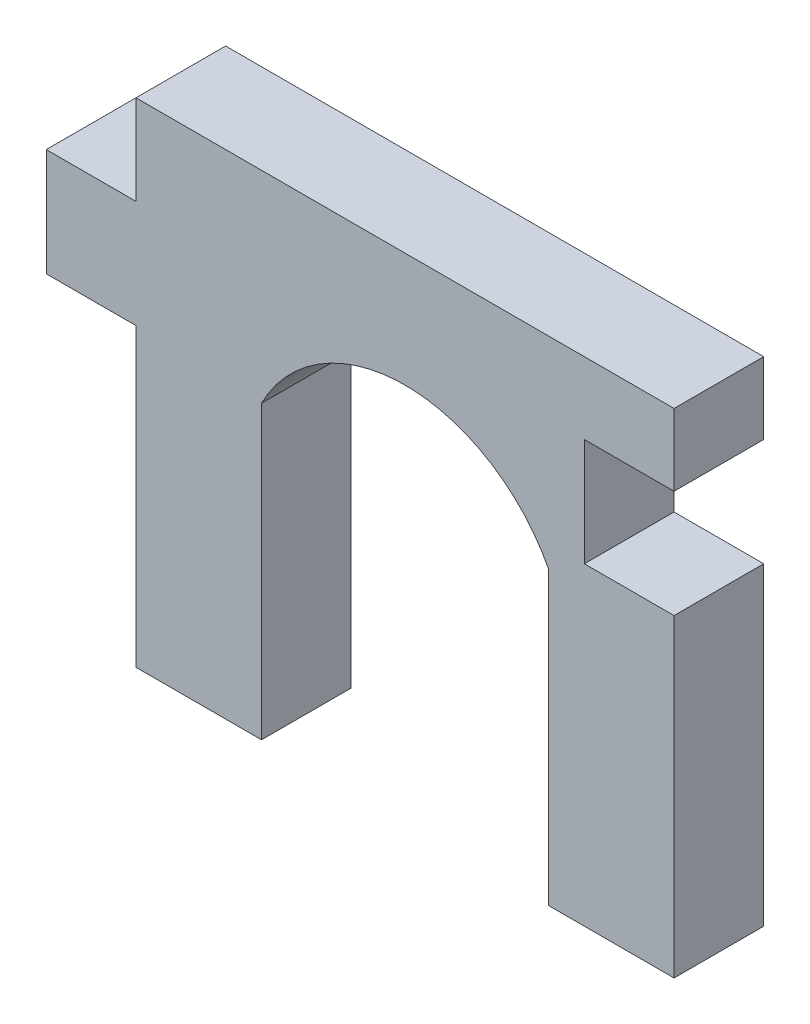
from build123d import *

# Parameters (mm, degrees)
SKETCH1_W           = 6.35
SKETCH1_H           = 7.62
SKETCH1_W_2         = 8.89
SKETCH1_H_2         = 6.35
BOSS_EXTRUDE2_DEPTH = 6.35
SKETCH2_W           = 6.35
SKETCH2_H           = 7.62
CUT_EXTRUDE1_DEPTH  = 12.7


with BuildPart() as part:
    # Sketch1 → Boss-Extrude2 (new body)
    with BuildSketch(Plane.XY):
        with BuildLine():
            Line((-8.89, 0), (0, 0))
            Line((0, 0), (0, 28.575))
            Line((0, 28.575), (-38.1, 28.575))
            Line((-38.1, 28.575), (-38.1, 22.225))
            Line((-38.1, 22.225), (-38.1, 14.605))
            Line((-38.1, 14.605), (-38.1, 0))
            Line((-38.1, 0), (-29.21, 0))
            Line((-29.21, 0), (-29.21, 14.29004))
            ThreePointArc((-29.21, 14.29004), (-19.05, 20.483695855), (-8.89, 14.29004))
            Line((-8.89, 14.29004), (-8.89, 0))
        make_face()
        with Locations((-41.275, 18.415)):
            Rectangle(SKETCH1_W, SKETCH1_H)
        with BuildLine():
            Line((-8.89, 0), (0, 0))
            Line((0, 0), (0, 28.575))
            Line((0, 28.575), (-38.1, 28.575))
            Line((-38.1, 28.575), (-38.1, 22.225))
            Line((-38.1, 22.225), (-38.1, 14.605))
            Line((-38.1, 14.605), (-38.1, 0))
            Line((-38.1, 0), (-29.21, 0))
            Line((-29.21, 0), (-29.21, 14.29004))
            ThreePointArc((-29.21, 14.29004), (-19.05, 20.483695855), (-8.89, 14.29004))
            Line((-8.89, 14.29004), (-8.89, 0))
        make_face()
        with Locations((-33.655, -3.175)):
            Rectangle(SKETCH1_W_2, SKETCH1_H_2)
        with Locations((-4.445, -3.175)):
            Rectangle(SKETCH1_W_2, SKETCH1_H_2)
    extrude(amount=BOSS_EXTRUDE2_DEPTH)

    # Sketch2 → Cut-Extrude1 (cut)
    with BuildSketch(Plane.XY.offset(6.35)):
        with Locations((-3.175, 19.685)):
            Rectangle(SKETCH2_W, SKETCH2_H)
    extrude(amount=-CUT_EXTRUDE1_DEPTH, mode=Mode.SUBTRACT)


solid = part.part
